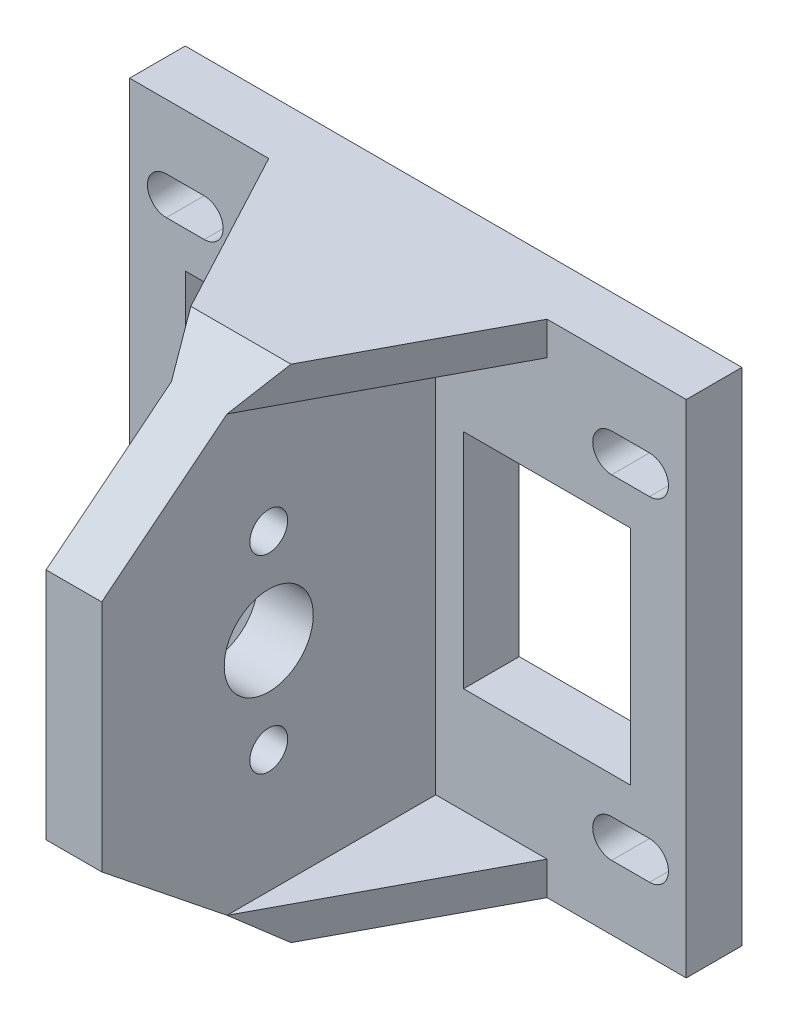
from build123d import *

# Parameters (mm, degrees)
SKETCH_1_W              = 50
SKETCH_1_H              = 45
EXTRUDE_1_DEPTH         = 5
SKETCH_2_W              = 5
SKETCH_2_H              = 45
EXTRUDE_2_DEPTH         = 30
SKETCH_4_R              = 4
CUT_EXTRUDE_1_DEPTH     = 50.874843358
HOLE_WIZARD_3_4_3_4_1_D = 3.4
HOLE_WIZARD_3_4_3_4_2_D = 3.4
EXTRUDE_4_DEPTH         = 3
SKETCH_13_W             = 15
SKETCH_13_H             = 20
CUT_EXTRUDE_5_DEPTH     = 46.069390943
SKETCH_14_R             = 3
CUT_EXTRUDE_6_DEPTH     = 2
CUT_EXTRUDE_7_DEPTH     = 46.069390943
CUT_EXTRUDE_9_DEPTH     = 66.048059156
CUT_EXTRUDE_10_DEPTH    = 63.24949799


with BuildPart() as part:
    # Sketch 1 → Extrude 1 (new body)
    with BuildSketch(Plane.XY):
        Rectangle(SKETCH_1_W, SKETCH_1_H)
    extrude(amount=EXTRUDE_1_DEPTH)

    # Sketch 2 → Extrude 2 (add)
    with BuildSketch(Plane.XY.offset(5)):
        Rectangle(SKETCH_2_W, SKETCH_2_H)
    extrude(amount=EXTRUDE_2_DEPTH)

    # Sketch 4 → Cut-Extrude 1 (cut, through all)
    with BuildSketch(Plane(origin=(2.5, 0, 0), x_dir=(0, 0, -1), z_dir=(1, 0, 0))):
        with Locations(Location((-20, 0, 0), (0, 0, 90))):
            Circle(SKETCH_4_R)
    extrude(amount=-CUT_EXTRUDE_1_DEPTH, mode=Mode.SUBTRACT)

    # Hole Wizard 3.4 _3.4_ _1 (through all)
    with Locations(Plane.ZY.offset(25)):
        with Locations((20, -8.5), (20, 8.5)):
            Hole(HOLE_WIZARD_3_4_3_4_1_D / 2)

    # Hole Wizard 3.4 _3.4_ _2 (through all)
    with Locations(Plane.XY.offset(5)):
        with Locations((20, 15), (-20, 15), (20, -15), (-20, -15)):
            Hole(HOLE_WIZARD_3_4_3_4_2_D / 2)

    # Sketch 9 → Extrude 4 (add)
    with BuildSketch(Plane(origin=(0, 22.5, 0), x_dir=(1, 0, 0), z_dir=(0, 1, 0))):
        Polygon((-12.5, -5), (-2.5, -5), (-2.5, -35), align=None)
        Polygon((2.5, -5), (2.5, -35), (12.5, -5), align=None)
    extrude_4 = extrude(amount=-EXTRUDE_4_DEPTH)

    # Mirror 2: Extrude 4 across plane
    add(extrude_4.mirror(Plane.ZX))

    # Sketch 13 → Cut-Extrude 5 (cut, through all)
    with BuildSketch(Plane.XY.offset(5)):
        with Locations((-12.5, 0)):
            Rectangle(SKETCH_13_W, SKETCH_13_H)
    cut_extrude_5 = extrude(amount=-CUT_EXTRUDE_5_DEPTH, mode=Mode.SUBTRACT)

    # Mirror 4: Cut-Extrude 5 across plane
    add(cut_extrude_5.mirror(Plane(origin=(0, 0, 0), x_dir=(0, 0, 1), z_dir=(1, 0, 0))), mode=Mode.SUBTRACT)

    # Sketch 14 → Cut-Extrude 6 (cut)
    with BuildSketch(Plane.ZY.offset(2.5)):
        with Locations(Location((20, 8.5, 0), (0, 0, 270))):
            Circle(SKETCH_14_R)
        with Locations(Location((20, -8.5, 0), (0, 0, 270))):
            Circle(SKETCH_14_R)
    extrude(amount=-CUT_EXTRUDE_6_DEPTH, mode=Mode.SUBTRACT)

    # Sketch 15 → Cut-Extrude 7 (cut, through all)
    with BuildSketch(Plane.XY.offset(5)):
        with BuildLine():
            Line((-21.7, 16.7), (-18.3, 16.7))
            ThreePointArc((-18.3, 16.7), (-16.6, 15), (-18.3, 13.3))
            Line((-18.3, 13.3), (-21.7, 13.3))
            ThreePointArc((-21.7, 13.3), (-23.4, 15), (-21.7, 16.7))
        make_face()
        with BuildLine():
            Line((18.3, 16.7), (21.7, 16.7))
            ThreePointArc((21.7, 16.7), (23.4, 15), (21.7, 13.3))
            Line((21.7, 13.3), (18.3, 13.3))
            ThreePointArc((18.3, 13.3), (16.6, 15), (18.3, 16.7))
        make_face()
        with BuildLine():
            Line((-21.7, -13.3), (-18.3, -13.3))
            ThreePointArc((-18.3, -13.3), (-16.6, -15), (-18.3, -16.7))
            Line((-18.3, -16.7), (-21.7, -16.7))
            ThreePointArc((-21.7, -16.7), (-23.4, -15), (-21.7, -13.3))
        make_face()
        with BuildLine():
            Line((18.3, -13.3), (21.7, -13.3))
            ThreePointArc((21.7, -13.3), (23.4, -15), (21.7, -16.7))
            Line((21.7, -16.7), (18.3, -16.7))
            ThreePointArc((18.3, -16.7), (16.6, -15), (18.3, -13.3))
        make_face()
    extrude(amount=-CUT_EXTRUDE_7_DEPTH, mode=Mode.SUBTRACT)

    # Sketch 18 → Cut-Extrude 9 (cut, through all)
    with BuildSketch(Plane(origin=(25, 0, 0), x_dir=(0, 0, -1), z_dir=(1, 0, 0))):
        Polygon((-35, 22.5), (-35, 10.5), (-20, 22.5), align=None)
        Polygon((-35, -22.5), (-35, -10.5), (-20, -22.5), align=None)
    extrude(amount=-CUT_EXTRUDE_9_DEPTH, mode=Mode.SUBTRACT)

    # Sketch 19 → Cut-Extrude 10 (cut, through all)
    with BuildSketch(Plane(origin=(0, 22.5, 0), x_dir=(1, 0, 0), z_dir=(0, 1, 0))):
        Polygon((-2.5, -23.75), (-12.5, -5), (-6.25, -23.75), align=None)
        Polygon((2.5, -23.75), (12.5, -5), (6.25, -23.75), align=None)
    extrude(amount=-CUT_EXTRUDE_10_DEPTH, mode=Mode.SUBTRACT)


solid = part.part
